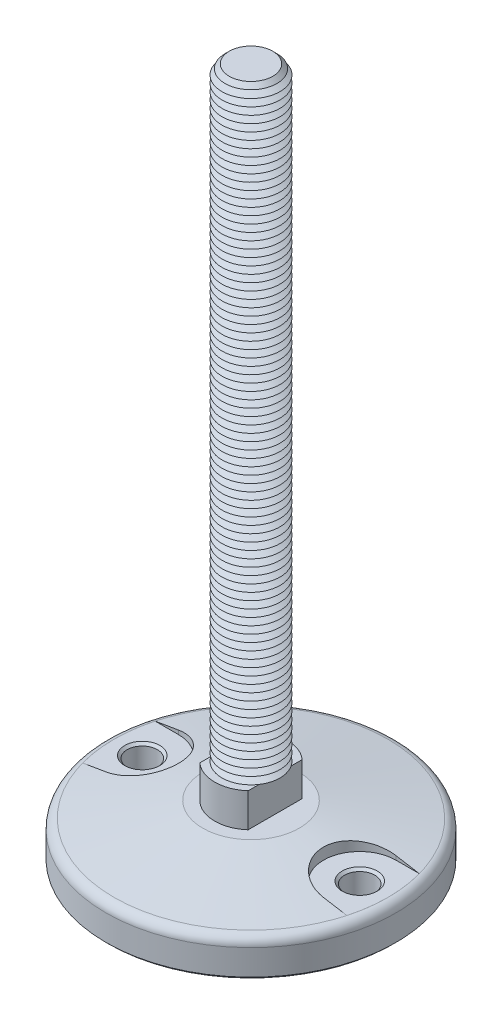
from build123d import *

# Parameters (mm, degrees)
FILLET1_R                = 4
SKETCH3_R                = 15
BOSS_EXTRUDE1_DEPTH      = 14
CUT_EXTRUDE1_START       = -14
CUT_EXTRUDE1_DEPTH       = 14
SKETCH5_R                = 12
BOSS_EXTRUDE2_DEPTH      = 250
CHAMFER1_SIZE            = 3
LPATTERN1_COUNT          = 83
LPATTERN1_PITCH          = 3
CUT_EXTRUDE4_DEPTH       = 6.47
SKETCH10_R               = 6.25
CUT_EXTRUDE5_DEPTH       = 15.53
CHAMFER2_SIZE            = 1
CHAMFER2_OF_MIRROR1_SIZE = 1
CHAMFER3_SIZE            = 1


with BuildPart() as part:
    # Sketch2 → Revolve1 (revolve)
    with BuildSketch(Plane(origin=(0, 0, 0), x_dir=(0, 0, -1), z_dir=(1, 0, 0)), mode=Mode.PRIVATE) as revolve1_sk:
        Polygon((0, 0), (-20, 0), (-60, -7.053079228), (-60, -22), (0, -22), align=None)
    revolve(revolve1_sk.sketch.rotate(Axis((0, 61.338865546, 0), (0, -1, 0)), 180), axis=Axis((0, 61.338865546, 0), (0, -1, 0)))

    # Fillet1
    fillet1_edges = [part.edges().sort_by_distance(p)[0] for p in [
        (0, -7.053079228, 60),
    ]]
    fillet(fillet1_edges, radius=FILLET1_R)

    # Sketch3 → Boss-Extrude1 (add)
    with BuildSketch(Plane(origin=(0, 0, 0), x_dir=(1, 0, 0), z_dir=(0, 1, 0))):
        with Locations(Location((0, 0, 0), (0, 0, 270))):
            Circle(SKETCH3_R)
    extrude(amount=BOSS_EXTRUDE1_DEPTH)

    # Sketch4 → Cut-Extrude1 (cut)
    with BuildSketch(Plane(origin=(0, 14, 0), x_dir=(1, 0, 0), z_dir=(0, 1, 0)).offset(CUT_EXTRUDE1_START)):
        with BuildLine():
            Line((-10, 11.180339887), (-10, -11.180339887))
            ThreePointArc((-10, -11.180339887), (-15, 0), (-10, 11.180339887))
        make_face()
        with BuildLine():
            Line((10, -11.180339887), (10, 11.180339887))
            ThreePointArc((10, 11.180339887), (15, 0), (10, -11.180339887))
        make_face()
    extrude(amount=CUT_EXTRUDE1_DEPTH, mode=Mode.SUBTRACT)

    # Sketch5 → Boss-Extrude2 (add)
    with BuildSketch(Plane(origin=(0, 14, 0), x_dir=(1, 0, 0), z_dir=(0, 1, 0))):
        with Locations(Location((0, 0, 0), (0, 0, 33.557309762))):
            Circle(SKETCH5_R)
    extrude(amount=BOSS_EXTRUDE2_DEPTH)

    # Chamfer1
    chamfer1_edges = [part.edges().sort_by_distance(p)[0] for p in [
        (-10, 264, 6.633249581),
    ]]
    chamfer(chamfer1_edges, length=CHAMFER1_SIZE)

    # Sketch6 → Cut-Revolve1 (revolve, cut)
    with BuildSketch(Plane(origin=(0, 0, 0), x_dir=(0, 0, -1), z_dir=(1, 0, 0))):
        Polygon((-12, 14), (-9.401923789, 15.5), (-12, 17), align=None)
    cut_revolve1 = revolve(axis=Axis((0, 61.338865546, 0), (0, -1, 0)), mode=Mode.SUBTRACT)

    # LPattern1: Cut-Revolve1 ×83
    with Locations(*[(0, i * LPATTERN1_PITCH, 0) for i in range(1, LPATTERN1_COUNT)]):
        add(cut_revolve1, mode=Mode.SUBTRACT)

    # Sketch8 → Cut-Extrude4 (cut)
    with BuildSketch(Plane(origin=(0, 0, 0), x_dir=(1, 0, 0), z_dir=(0, 1, 0))):
        with BuildLine():
            Line((-45, 15), (-54.674279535, 15))
            ThreePointArc((-54.674279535, 15), (-56.694592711, 0), (-54.674279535, -15))
            Line((-54.674279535, -15), (-45, -15))
            ThreePointArc((-45, -15), (-30, 0), (-45, 15))
        make_face()
    cut_extrude4 = extrude(amount=-CUT_EXTRUDE4_DEPTH, mode=Mode.SUBTRACT)

    # Sketch10 → Cut-Extrude5 (cut)
    with BuildSketch(Plane(origin=(0, -6.47, 0), x_dir=(1, 0, 0), z_dir=(0, 1, 0))):
        with Locations(Location((-45, 0, 0), (0, 0, 270))):
            Circle(SKETCH10_R)
    cut_extrude5 = extrude(amount=-CUT_EXTRUDE5_DEPTH, mode=Mode.SUBTRACT)

    # Chamfer2
    chamfer2_edges = [part.edges().sort_by_distance(p)[0] for p in [
        (-45, -6.47, -6.25),
        (-45, -22, -6.25),
    ]]
    chamfer(chamfer2_edges, length=CHAMFER2_SIZE)

    # Mirror1: Cut-Extrude4, Cut-Extrude5 across plane
    add(cut_extrude4.mirror(Plane(origin=(0, 0, 0), x_dir=(0, 0, 1), z_dir=(1, 0, 0))), mode=Mode.SUBTRACT)
    add(cut_extrude5.mirror(Plane(origin=(0, 0, 0), x_dir=(0, 0, 1), z_dir=(1, 0, 0))), mode=Mode.SUBTRACT)

    # Chamfer2 of Mirror1
    chamfer2_of_mirror1_edges = [part.edges().sort_by_distance(p)[0] for p in [
        (45, -6.47, -6.25),
        (45, -22, -6.25),
    ]]
    chamfer(chamfer2_of_mirror1_edges, length=CHAMFER2_OF_MIRROR1_SIZE)

    # Chamfer3
    chamfer3_edges = [part.edges().sort_by_distance(p)[0] for p in [
        (0, -22, 60),
    ]]
    chamfer(chamfer3_edges, length=CHAMFER3_SIZE)


solid = part.part
